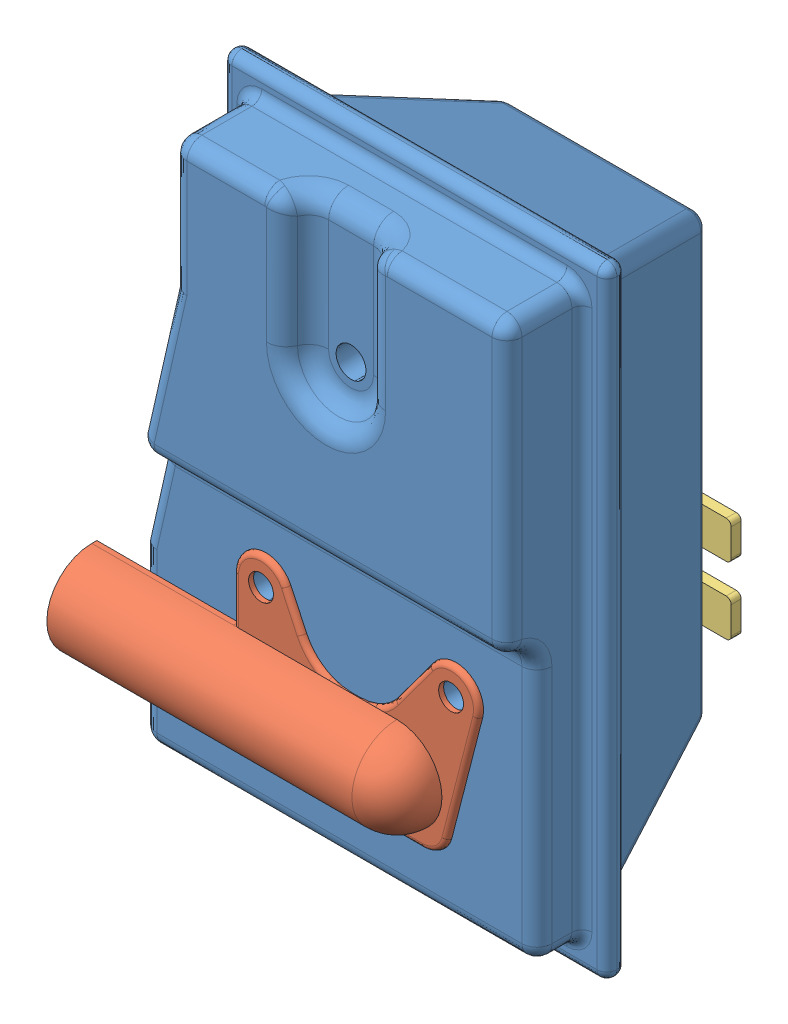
SolidWorks assembly Pot ensemble.SLDASM, configuration Défaut (file format 11000). Lengths in mm.
Overall size (93 124 59).
3 component instances, 3 part files, 6 mates.
Components (placement in the parent):
- Pot-1: Pot.SLDPRT [Défaut] at (-47.5153 -53.504 124) size (89 124 55)
- Tuyau pot-1: Tuyau pot.sldprt [Défaut] at (4.1993 -3.7504 -10.5) size (77.32 34.7 10.56)
- Joint de pot-1: Joint de pot.sldprt [Défaut] at (-3.6903 50.6152 86) size (54 25 2)
Mates (geometry in assembly coordinates):
- Coaxiale1: concentric: cylinder of Pot-1 through (-22.6903 -13.8848 86) axis (0 0 1) radius 2.5; cylinder of Joint de pot-1 through (-22.6903 -13.8848 88) axis (0 0 -1) radius 3
- Coïncidente1: coincident: plane of Pot-1 through (-47.5153 -53.504 88) normal (0 0 -1); plane of Joint de pot-1 through (8.3097 -22.7878 88) normal (0 0 1)
- Coaxiale2: concentric: cylinder of Pot-1 through (15.3097 -13.8848 86) axis (0 0 1) radius 2.5; cylinder of Joint de pot-1 through (15.3097 -13.8848 88) axis (0 0 -1) radius 3
- Coïncidente2: coincident: plane of Pot-1 through (-47.5153 -53.504 135) normal (0 0 1); plane of Tuyau pot-1 through (15.3097 -13.8848 135) normal (0 0 -1)
- Coaxiale3: concentric: cylinder of Pot-1 through (15.3097 -13.8848 86) axis (0 0 1) radius 2.5; cylinder of Tuyau pot-1 through (15.3097 -13.8848 135) axis (0 0 1) radius 2.5
- Coaxiale4: concentric: cylinder of Pot-1 through (-22.6903 -13.8848 86) axis (0 0 1) radius 2.5; cylinder of Tuyau pot-1 through (-22.6903 -13.8848 135) axis (0 0 1) radius 2.5
